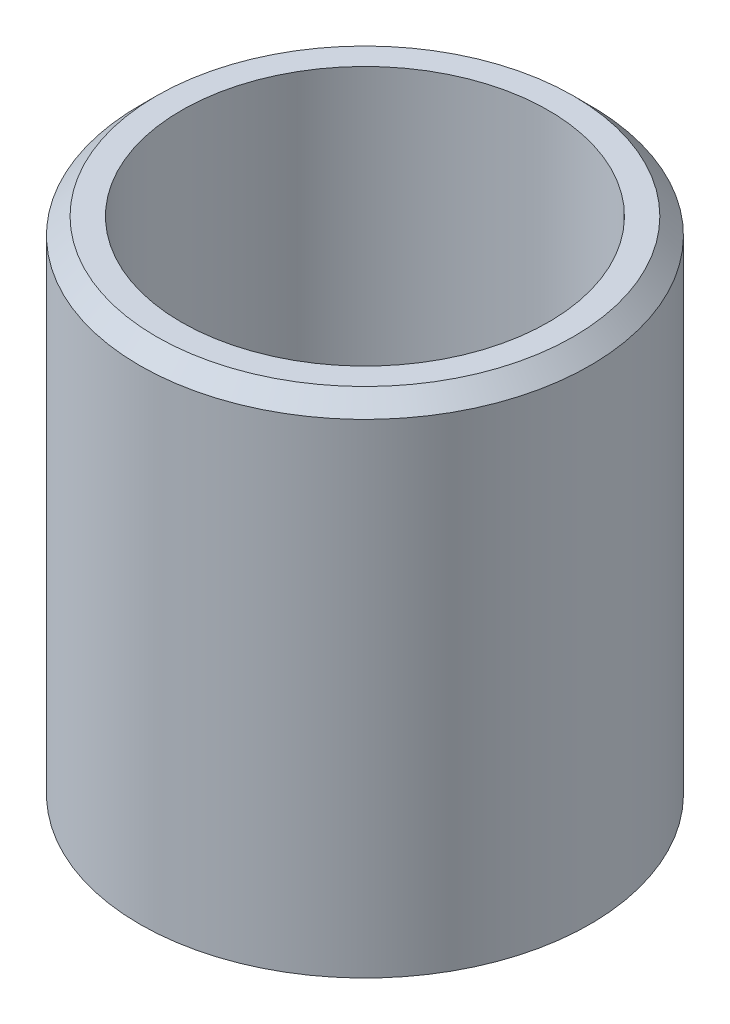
ISO-10303-21;
HEADER;
FILE_DESCRIPTION(('STEP AP214'),'2;1');
FILE_NAME('part.step','',(''),(''),'','','');
FILE_SCHEMA(('AUTOMOTIVE_DESIGN { 1 0 10303 214 1 1 1 1 }'));
ENDSEC;
DATA;
#1=APPLICATION_CONTEXT('core data for automotive mechanical design processes');
#2=APPLICATION_PROTOCOL_DEFINITION('international standard','automotive_design',2000,#1);
#3=PRODUCT_CONTEXT('',#1,'mechanical');
#4=PRODUCT('Part','Part','',(#3));
#5=PRODUCT_RELATED_PRODUCT_CATEGORY('part','',(#4));
#6=PRODUCT_DEFINITION_FORMATION('','',#4);
#7=PRODUCT_DEFINITION_CONTEXT('part definition',#1,'design');
#8=PRODUCT_DEFINITION('design','',#6,#7);
#9=PRODUCT_DEFINITION_SHAPE('','',#8);
#10=(LENGTH_UNIT() NAMED_UNIT(*) SI_UNIT(.MILLI.,.METRE.));
#11=(NAMED_UNIT(*) PLANE_ANGLE_UNIT() SI_UNIT($,.RADIAN.));
#12=(NAMED_UNIT(*) SI_UNIT($,.STERADIAN.) SOLID_ANGLE_UNIT());
#13=UNCERTAINTY_MEASURE_WITH_UNIT(LENGTH_MEASURE(1.E-05),#10,'distance_accuracy_value','');
#14=(GEOMETRIC_REPRESENTATION_CONTEXT(3) GLOBAL_UNCERTAINTY_ASSIGNED_CONTEXT((#13)) GLOBAL_UNIT_ASSIGNED_CONTEXT((#10,
#11,#12)) REPRESENTATION_CONTEXT('',''));
#15=CARTESIAN_POINT('',(0.,0.,0.));
#16=DIRECTION('',(0.,0.,1.));
#17=DIRECTION('',(1.,0.,0.));
#18=AXIS2_PLACEMENT_3D('',#15,#16,#17);
#19=CARTESIAN_POINT('',(0.,30.,0.));
#20=DIRECTION('',(0.,1.,0.));
#21=DIRECTION('',(0.,0.,1.));
#22=AXIS2_PLACEMENT_3D('',#19,#20,#21);
#23=PLANE('',#22);
#24=CARTESIAN_POINT('',(0.,30.,0.));
#25=DIRECTION('',(0.,1.,0.));
#26=DIRECTION('',(0.,0.,1.));
#27=AXIS2_PLACEMENT_3D('',#24,#25,#26);
#28=CIRCLE('',#27,12.5);
#29=CARTESIAN_POINT('',(0.,30.,12.5));
#30=VERTEX_POINT('',#29);
#31=EDGE_CURVE('E35',#30,#30,#28,.T.);
#32=ORIENTED_EDGE('',*,*,#31,.T.);
#33=EDGE_LOOP('',(#32));
#34=FACE_BOUND('',#33,.T.);
#35=CARTESIAN_POINT('',(0.,30.,0.));
#36=DIRECTION('',(0.,1.,0.));
#37=DIRECTION('',(0.,0.,1.));
#38=AXIS2_PLACEMENT_3D('',#35,#36,#37);
#39=CIRCLE('',#38,11.);
#40=CARTESIAN_POINT('',(0.,30.,11.));
#41=VERTEX_POINT('',#40);
#42=EDGE_CURVE('E43',#41,#41,#39,.T.);
#43=ORIENTED_EDGE('',*,*,#42,.F.);
#44=EDGE_LOOP('',(#43));
#45=FACE_BOUND('',#44,.T.);
#46=ADVANCED_FACE('F28',(#34,#45),#23,.T.);
#47=CARTESIAN_POINT('',(0.,0.,0.));
#48=DIRECTION('',(0.,1.,0.));
#49=DIRECTION('',(0.,0.,1.));
#50=AXIS2_PLACEMENT_3D('',#47,#48,#49);
#51=PLANE('',#50);
#52=CARTESIAN_POINT('',(0.,0.,0.));
#53=DIRECTION('',(0.,1.,0.));
#54=DIRECTION('',(0.,0.,1.));
#55=AXIS2_PLACEMENT_3D('',#52,#53,#54);
#56=CIRCLE('',#55,13.5);
#57=CARTESIAN_POINT('',(0.,0.,13.5));
#58=VERTEX_POINT('',#57);
#59=EDGE_CURVE('E39',#58,#58,#56,.T.);
#60=ORIENTED_EDGE('',*,*,#59,.F.);
#61=EDGE_LOOP('',(#60));
#62=FACE_BOUND('',#61,.T.);
#63=CARTESIAN_POINT('',(0.,0.,0.));
#64=DIRECTION('',(0.,1.,0.));
#65=DIRECTION('',(0.,0.,1.));
#66=AXIS2_PLACEMENT_3D('',#63,#64,#65);
#67=CIRCLE('',#66,11.);
#68=CARTESIAN_POINT('',(0.,0.,11.));
#69=VERTEX_POINT('',#68);
#70=EDGE_CURVE('E48',#69,#69,#67,.T.);
#71=ORIENTED_EDGE('',*,*,#70,.T.);
#72=EDGE_LOOP('',(#71));
#73=FACE_BOUND('',#72,.T.);
#74=ADVANCED_FACE('F52',(#62,#73),#51,.F.);
#75=CARTESIAN_POINT('',(0.,30.,0.));
#76=DIRECTION('',(0.,-1.,0.));
#77=DIRECTION('',(0.,0.,-1.));
#78=AXIS2_PLACEMENT_3D('',#75,#76,#77);
#79=CYLINDRICAL_SURFACE('',#78,13.5);
#80=CARTESIAN_POINT('',(0.,29.,0.));
#81=DIRECTION('',(0.,1.,0.));
#82=DIRECTION('',(0.,0.,1.));
#83=AXIS2_PLACEMENT_3D('',#80,#81,#82);
#84=CIRCLE('',#83,13.5);
#85=CARTESIAN_POINT('',(0.,29.,13.5));
#86=VERTEX_POINT('',#85);
#87=EDGE_CURVE('E10',#86,#86,#84,.F.);
#88=ORIENTED_EDGE('',*,*,#87,.T.);
#89=EDGE_LOOP('',(#88));
#90=FACE_BOUND('',#89,.T.);
#91=ORIENTED_EDGE('',*,*,#59,.T.);
#92=EDGE_LOOP('',(#91));
#93=FACE_BOUND('',#92,.T.);
#94=ADVANCED_FACE('F30',(#90,#93),#79,.T.);
#95=CARTESIAN_POINT('',(0.,30.,0.));
#96=DIRECTION('',(0.,-1.,0.));
#97=DIRECTION('',(0.,0.,-1.));
#98=AXIS2_PLACEMENT_3D('',#95,#96,#97);
#99=CYLINDRICAL_SURFACE('',#98,11.);
#100=ORIENTED_EDGE('',*,*,#42,.T.);
#101=EDGE_LOOP('',(#100));
#102=FACE_BOUND('',#101,.T.);
#103=ORIENTED_EDGE('',*,*,#70,.F.);
#104=EDGE_LOOP('',(#103));
#105=FACE_BOUND('',#104,.T.);
#106=ADVANCED_FACE('F54',(#102,#105),#99,.F.);
#107=CARTESIAN_POINT('',(0.,30.,0.));
#108=DIRECTION('',(0.,-1.,0.));
#109=DIRECTION('',(0.,0.,-1.));
#110=AXIS2_PLACEMENT_3D('',#107,#108,#109);
#111=CONICAL_SURFACE('',#110,12.5,0.785398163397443);
#112=ORIENTED_EDGE('',*,*,#87,.F.);
#113=EDGE_LOOP('',(#112));
#114=FACE_BOUND('',#113,.T.);
#115=ORIENTED_EDGE('',*,*,#31,.F.);
#116=EDGE_LOOP('',(#115));
#117=FACE_BOUND('',#116,.T.);
#118=ADVANCED_FACE('F56',(#114,#117),#111,.T.);
#119=CLOSED_SHELL('',(#46,#74,#94,#106,#118));
#120=MANIFOLD_SOLID_BREP('B2',#119);
#121=ADVANCED_BREP_SHAPE_REPRESENTATION('',(#18,#120),#14);
#122=SHAPE_DEFINITION_REPRESENTATION(#9,#121);
ENDSEC;
END-ISO-10303-21;
